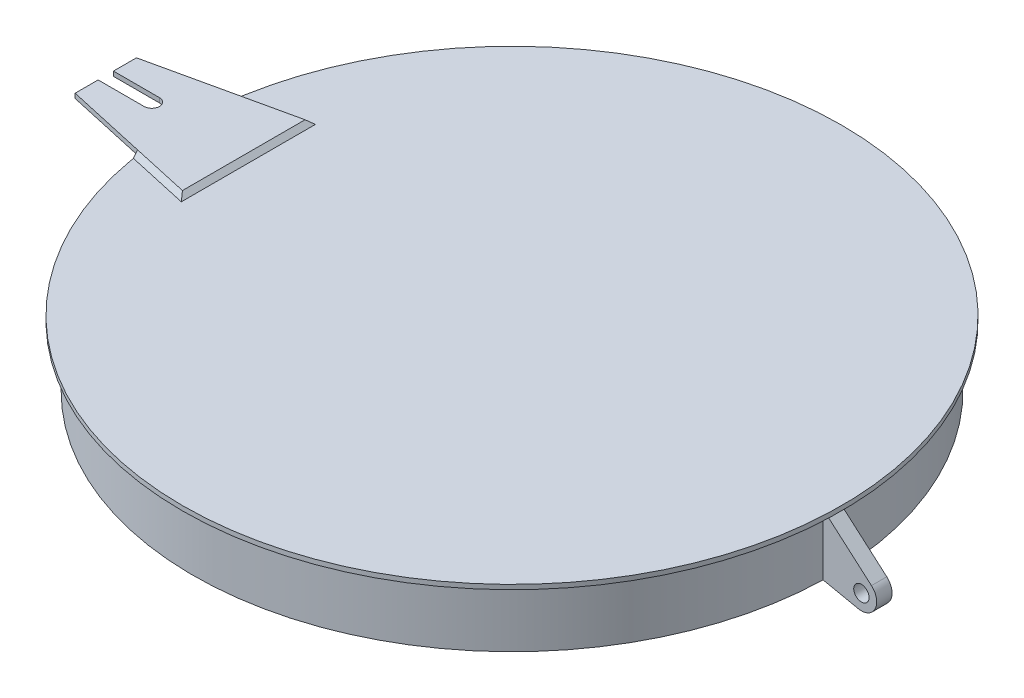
ISO-10303-21;
HEADER;
FILE_DESCRIPTION(('STEP AP214'),'2;1');
FILE_NAME('part.step','',(''),(''),'','','');
FILE_SCHEMA(('AUTOMOTIVE_DESIGN { 1 0 10303 214 1 1 1 1 }'));
ENDSEC;
DATA;
#1=APPLICATION_CONTEXT('core data for automotive mechanical design processes');
#2=APPLICATION_PROTOCOL_DEFINITION('international standard','automotive_design',2000,#1);
#3=PRODUCT_CONTEXT('',#1,'mechanical');
#4=PRODUCT('Part','Part','',(#3));
#5=PRODUCT_RELATED_PRODUCT_CATEGORY('part','',(#4));
#6=PRODUCT_DEFINITION_FORMATION('','',#4);
#7=PRODUCT_DEFINITION_CONTEXT('part definition',#1,'design');
#8=PRODUCT_DEFINITION('design','',#6,#7);
#9=PRODUCT_DEFINITION_SHAPE('','',#8);
#10=(LENGTH_UNIT() NAMED_UNIT(*) SI_UNIT(.MILLI.,.METRE.));
#11=(NAMED_UNIT(*) PLANE_ANGLE_UNIT() SI_UNIT($,.RADIAN.));
#12=(NAMED_UNIT(*) SI_UNIT($,.STERADIAN.) SOLID_ANGLE_UNIT());
#13=UNCERTAINTY_MEASURE_WITH_UNIT(LENGTH_MEASURE(1.E-05),#10,'distance_accuracy_value','');
#14=(GEOMETRIC_REPRESENTATION_CONTEXT(3) GLOBAL_UNCERTAINTY_ASSIGNED_CONTEXT((#13)) GLOBAL_UNIT_ASSIGNED_CONTEXT((#10,
#11,#12)) REPRESENTATION_CONTEXT('',''));
#15=CARTESIAN_POINT('',(0.,0.,0.));
#16=DIRECTION('',(0.,0.,1.));
#17=DIRECTION('',(1.,0.,0.));
#18=AXIS2_PLACEMENT_3D('',#15,#16,#17);
#19=CARTESIAN_POINT('',(204.939015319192,40.,5.0000000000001));
#20=DIRECTION('',(0.0243902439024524,0.,-0.999702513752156));
#21=DIRECTION('',(-0.999702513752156,0.,-0.0243902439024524));
#22=AXIS2_PLACEMENT_3D('',#19,#20,#21);
#23=PLANE('',#22);
#24=DIRECTION('',(-0.706896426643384,-0.707106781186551,-0.0172465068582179));
#25=VECTOR('',#24,1.);
#26=CARTESIAN_POINT('',(0.,-171.000000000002,-2.64119790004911E-12));
#27=LINE('',#26,#25);
#28=CARTESIAN_POINT('',(210.937230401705,40.,5.14634146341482));
#29=VERTEX_POINT('',#28);
#30=CARTESIAN_POINT('',(207.938122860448,37.,5.07317073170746));
#31=VERTEX_POINT('',#30);
#32=EDGE_CURVE('E59',#29,#31,#27,.T.);
#33=ORIENTED_EDGE('',*,*,#32,.T.);
#34=DIRECTION('',(0.,-1.,0.));
#35=VECTOR('',#34,1.);
#36=CARTESIAN_POINT('',(207.938122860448,40.,5.07317073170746));
#37=LINE('',#36,#35);
#38=CARTESIAN_POINT('',(207.938122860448,40.,5.07317073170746));
#39=VERTEX_POINT('',#38);
#40=EDGE_CURVE('E66',#39,#31,#37,.T.);
#41=ORIENTED_EDGE('',*,*,#40,.F.);
#42=DIRECTION('',(0.999702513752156,0.,0.0243902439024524));
#43=VECTOR('',#42,1.);
#44=CARTESIAN_POINT('',(204.939015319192,40.,5.0000000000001));
#45=LINE('',#44,#43);
#46=EDGE_CURVE('E89',#39,#29,#45,.T.);
#47=ORIENTED_EDGE('',*,*,#46,.T.);
#48=EDGE_LOOP('',(#33,#41,#47));
#49=FACE_BOUND('',#48,.T.);
#50=ADVANCED_FACE('F51',(#49),#23,.T.);
#51=CARTESIAN_POINT('',(207.938122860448,40.,-5.07317073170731));
#52=DIRECTION('',(0.0243902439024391,0.,0.999702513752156));
#53=DIRECTION('',(0.999702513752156,0.,-0.0243902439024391));
#54=AXIS2_PLACEMENT_3D('',#51,#52,#53);
#55=PLANE('',#54);
#56=DIRECTION('',(-0.999702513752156,0.,0.0243902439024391));
#57=VECTOR('',#56,1.);
#58=CARTESIAN_POINT('',(207.938122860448,40.,-5.07317073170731));
#59=LINE('',#58,#57);
#60=CARTESIAN_POINT('',(210.937230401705,40.,-5.14634146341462));
#61=VERTEX_POINT('',#60);
#62=CARTESIAN_POINT('',(207.938122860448,40.,-5.07317073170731));
#63=VERTEX_POINT('',#62);
#64=EDGE_CURVE('E88',#61,#63,#59,.T.);
#65=ORIENTED_EDGE('',*,*,#64,.T.);
#66=DIRECTION('',(0.,-1.,0.));
#67=VECTOR('',#66,1.);
#68=CARTESIAN_POINT('',(207.938122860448,40.,-5.07317073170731));
#69=LINE('',#68,#67);
#70=CARTESIAN_POINT('',(207.938122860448,37.,-5.07317073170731));
#71=VERTEX_POINT('',#70);
#72=EDGE_CURVE('E90',#63,#71,#69,.T.);
#73=ORIENTED_EDGE('',*,*,#72,.T.);
#74=DIRECTION('',(0.706896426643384,0.707106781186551,-0.0172465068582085));
#75=VECTOR('',#74,1.);
#76=CARTESIAN_POINT('',(0.,-171.000000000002,0.));
#77=LINE('',#76,#75);
#78=EDGE_CURVE('E12',#71,#61,#77,.T.);
#79=ORIENTED_EDGE('',*,*,#78,.T.);
#80=EDGE_LOOP('',(#65,#73,#79));
#81=FACE_BOUND('',#80,.T.);
#82=ADVANCED_FACE('F99',(#81),#55,.T.);
#83=CARTESIAN_POINT('',(0.,40.,0.));
#84=DIRECTION('',(0.,1.,0.));
#85=DIRECTION('',(0.,0.,1.));
#86=AXIS2_PLACEMENT_3D('',#83,#84,#85);
#87=CONICAL_SURFACE('',#86,211.,0.785398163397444);
#88=ORIENTED_EDGE('',*,*,#78,.F.);
#89=CARTESIAN_POINT('',(0.,37.,0.));
#90=DIRECTION('',(0.,1.,0.));
#91=DIRECTION('',(0.,0.,1.));
#92=AXIS2_PLACEMENT_3D('',#89,#90,#91);
#93=CIRCLE('',#92,208.);
#94=EDGE_CURVE('E95',#31,#71,#93,.F.);
#95=ORIENTED_EDGE('',*,*,#94,.F.);
#96=ORIENTED_EDGE('',*,*,#32,.F.);
#97=CARTESIAN_POINT('',(0.,40.,0.));
#98=DIRECTION('',(0.,1.,0.));
#99=DIRECTION('',(0.,0.,1.));
#100=AXIS2_PLACEMENT_3D('',#97,#98,#99);
#101=CIRCLE('',#100,211.);
#102=EDGE_CURVE('E74',#61,#29,#101,.T.);
#103=ORIENTED_EDGE('',*,*,#102,.F.);
#104=EDGE_LOOP('',(#88,#95,#96,#103));
#105=FACE_BOUND('',#104,.T.);
#106=ADVANCED_FACE('F53',(#105),#87,.T.);
#107=CARTESIAN_POINT('',(0.,40.,0.));
#108=DIRECTION('',(0.,-1.,0.));
#109=DIRECTION('',(0.,0.,-1.));
#110=AXIS2_PLACEMENT_3D('',#107,#108,#109);
#111=CYLINDRICAL_SURFACE('',#110,208.);
#112=ORIENTED_EDGE('',*,*,#94,.T.);
#113=ORIENTED_EDGE('',*,*,#72,.F.);
#114=CARTESIAN_POINT('',(0.,40.,0.));
#115=DIRECTION('',(0.,1.,0.));
#116=DIRECTION('',(0.,0.,1.));
#117=AXIS2_PLACEMENT_3D('',#114,#115,#116);
#118=CIRCLE('',#117,208.);
#119=EDGE_CURVE('E84',#63,#39,#118,.T.);
#120=ORIENTED_EDGE('',*,*,#119,.T.);
#121=ORIENTED_EDGE('',*,*,#40,.T.);
#122=EDGE_LOOP('',(#112,#113,#120,#121));
#123=FACE_BOUND('',#122,.T.);
#124=ADVANCED_FACE('F93',(#123),#111,.F.);
#125=CARTESIAN_POINT('',(0.,40.,0.));
#126=DIRECTION('',(0.,1.,0.));
#127=DIRECTION('',(0.,0.,1.));
#128=AXIS2_PLACEMENT_3D('',#125,#126,#127);
#129=PLANE('',#128);
#130=ORIENTED_EDGE('',*,*,#119,.F.);
#131=ORIENTED_EDGE('',*,*,#64,.F.);
#132=ORIENTED_EDGE('',*,*,#102,.T.);
#133=ORIENTED_EDGE('',*,*,#46,.F.);
#134=EDGE_LOOP('',(#130,#131,#132,#133));
#135=FACE_BOUND('',#134,.T.);
#136=ADVANCED_FACE('F86',(#135),#129,.T.);
#137=CLOSED_SHELL('',(#50,#82,#106,#124,#136));
#138=MANIFOLD_SOLID_BREP('B2',#137);
#139=CARTESIAN_POINT('',(0.,43.,0.));
#140=DIRECTION('',(0.,-1.,0.));
#141=DIRECTION('',(0.,0.,-1.));
#142=AXIS2_PLACEMENT_3D('',#139,#140,#141);
#143=CYLINDRICAL_SURFACE('',#142,215.);
#144=CARTESIAN_POINT('',(0.,123.010312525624,0.));
#145=DIRECTION('',(0.153392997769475,-0.707106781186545,0.690268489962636));
#146=DIRECTION('',(-0.153392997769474,-0.70710678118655,-0.690268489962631));
#147=AXIS2_PLACEMENT_3D('',#144,#145,#146);
#148=ELLIPSE('',#147,304.055915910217,215.);
#149=CARTESIAN_POINT('',(-212.660479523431,46.,-31.6310045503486));
#150=VERTEX_POINT('',#149);
#151=CARTESIAN_POINT('',(-212.162499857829,43.,-34.8148481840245));
#152=VERTEX_POINT('',#151);
#153=EDGE_CURVE('E173',#150,#152,#148,.T.);
#154=ORIENTED_EDGE('',*,*,#153,.T.);
#155=CARTESIAN_POINT('',(0.,43.,0.));
#156=DIRECTION('',(0.,1.,0.));
#157=DIRECTION('',(0.,0.,1.));
#158=AXIS2_PLACEMENT_3D('',#155,#156,#157);
#159=CIRCLE('',#158,215.);
#160=CARTESIAN_POINT('',(-212.660479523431,43.,-31.6310045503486));
#161=VERTEX_POINT('',#160);
#162=EDGE_CURVE('E237',#152,#161,#159,.T.);
#163=ORIENTED_EDGE('',*,*,#162,.T.);
#164=DIRECTION('',(0.,-1.,0.));
#165=VECTOR('',#164,1.);
#166=CARTESIAN_POINT('',(-212.660479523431,46.,-31.6310045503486));
#167=LINE('',#166,#165);
#168=EDGE_CURVE('E241',#150,#161,#167,.T.);
#169=ORIENTED_EDGE('',*,*,#168,.F.);
#170=EDGE_LOOP('',(#154,#163,#169));
#171=FACE_BOUND('',#170,.T.);
#172=ADVANCED_FACE('F164',(#171),#143,.T.);
#173=DIRECTION('',(0.,-1.,0.));
#174=VECTOR('',#173,1.);
#175=CARTESIAN_POINT('',(-212.660479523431,43.,31.6310045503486));
#176=LINE('',#175,#174);
#177=CARTESIAN_POINT('',(-212.660479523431,43.,31.6310045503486));
#178=VERTEX_POINT('',#177);
#179=CARTESIAN_POINT('',(-212.660479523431,46.,31.6310045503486));
#180=VERTEX_POINT('',#179);
#181=EDGE_CURVE('E222',#178,#180,#176,.F.);
#182=ORIENTED_EDGE('',*,*,#181,.F.);
#183=CARTESIAN_POINT('',(-212.162499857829,43.,34.8148481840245));
#184=VERTEX_POINT('',#183);
#185=EDGE_CURVE('E231',#178,#184,#159,.T.);
#186=ORIENTED_EDGE('',*,*,#185,.T.);
#187=CARTESIAN_POINT('',(0.,123.010312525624,0.));
#188=DIRECTION('',(0.153392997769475,-0.707106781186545,-0.690268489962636));
#189=DIRECTION('',(-0.153392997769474,-0.70710678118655,0.690268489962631));
#190=AXIS2_PLACEMENT_3D('',#187,#188,#189);
#191=ELLIPSE('',#190,304.055915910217,215.);
#192=EDGE_CURVE('E49',#184,#180,#191,.T.);
#193=ORIENTED_EDGE('',*,*,#192,.T.);
#194=EDGE_LOOP('',(#182,#186,#193));
#195=FACE_BOUND('',#194,.T.);
#196=ADVANCED_FACE('F239',(#195),#143,.T.);
#197=CARTESIAN_POINT('',(-17.3566737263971,43.,78.1050317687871));
#198=DIRECTION('',(0.153392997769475,-0.707106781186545,-0.690268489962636));
#199=DIRECTION('',(-0.976187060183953,0.,-0.216930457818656));
#200=AXIS2_PLACEMENT_3D('',#197,#198,#199);
#201=PLANE('',#200);
#202=ORIENTED_EDGE('',*,*,#192,.F.);
#203=DIRECTION('',(-0.976187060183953,0.,-0.216930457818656));
#204=VECTOR('',#203,1.);
#205=CARTESIAN_POINT('',(-17.3566737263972,43.,78.1050317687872));
#206=LINE('',#205,#204);
#207=CARTESIAN_POINT('',(-172.,43.,43.739848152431));
#208=VERTEX_POINT('',#207);
#209=EDGE_CURVE('E233',#208,#184,#206,.T.);
#210=ORIENTED_EDGE('',*,*,#209,.F.);
#211=DIRECTION('',(0.530442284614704,-0.530442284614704,0.661257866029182));
#212=VECTOR('',#211,1.);
#213=CARTESIAN_POINT('',(-187.342151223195,58.3421512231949,24.6140761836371));
#214=LINE('',#213,#212);
#215=CARTESIAN_POINT('',(-175.,46.,40.));
#216=VERTEX_POINT('',#215);
#217=EDGE_CURVE('E168',#216,#208,#214,.T.);
#218=ORIENTED_EDGE('',*,*,#217,.F.);
#219=DIRECTION('',(0.976187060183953,0.,0.216930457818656));
#220=VECTOR('',#219,1.);
#221=CARTESIAN_POINT('',(-240.647058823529,46.,25.4117647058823));
#222=LINE('',#221,#220);
#223=EDGE_CURVE('E254',#180,#216,#222,.T.);
#224=ORIENTED_EDGE('',*,*,#223,.F.);
#225=EDGE_LOOP('',(#202,#210,#218,#224));
#226=FACE_BOUND('',#225,.T.);
#227=ADVANCED_FACE('F166',(#226),#201,.F.);
#228=CARTESIAN_POINT('',(-172.,43.,0.));
#229=DIRECTION('',(-0.707106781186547,-0.707106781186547,0.));
#230=DIRECTION('',(0.,0.,1.));
#231=AXIS2_PLACEMENT_3D('',#228,#229,#230);
#232=PLANE('',#231);
#233=ORIENTED_EDGE('',*,*,#217,.T.);
#234=DIRECTION('',(0.,0.,1.));
#235=VECTOR('',#234,1.);
#236=CARTESIAN_POINT('',(-172.,43.,0.));
#237=LINE('',#236,#235);
#238=CARTESIAN_POINT('',(-172.,43.,-43.739848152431));
#239=VERTEX_POINT('',#238);
#240=EDGE_CURVE('E189',#239,#208,#237,.T.);
#241=ORIENTED_EDGE('',*,*,#240,.F.);
#242=DIRECTION('',(-0.530442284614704,0.530442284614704,0.661257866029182));
#243=VECTOR('',#242,1.);
#244=CARTESIAN_POINT('',(-187.342151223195,58.3421512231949,-24.6140761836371));
#245=LINE('',#244,#243);
#246=CARTESIAN_POINT('',(-175.,46.,-40.));
#247=VERTEX_POINT('',#246);
#248=EDGE_CURVE('E227',#247,#239,#245,.F.);
#249=ORIENTED_EDGE('',*,*,#248,.F.);
#250=DIRECTION('',(0.,0.,-1.));
#251=VECTOR('',#250,1.);
#252=CARTESIAN_POINT('',(-175.,46.,0.));
#253=LINE('',#252,#251);
#254=EDGE_CURVE('E261',#216,#247,#253,.T.);
#255=ORIENTED_EDGE('',*,*,#254,.F.);
#256=EDGE_LOOP('',(#233,#241,#249,#255));
#257=FACE_BOUND('',#256,.T.);
#258=ADVANCED_FACE('F278',(#257),#232,.F.);
#259=CARTESIAN_POINT('',(-17.3566737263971,43.,-78.1050317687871));
#260=DIRECTION('',(0.153392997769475,-0.707106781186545,0.690268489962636));
#261=DIRECTION('',(0.976187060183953,0.,-0.216930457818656));
#262=AXIS2_PLACEMENT_3D('',#259,#260,#261);
#263=PLANE('',#262);
#264=ORIENTED_EDGE('',*,*,#153,.F.);
#265=DIRECTION('',(-0.976187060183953,0.,0.216930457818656));
#266=VECTOR('',#265,1.);
#267=CARTESIAN_POINT('',(-240.647058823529,46.,-25.4117647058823));
#268=LINE('',#267,#266);
#269=EDGE_CURVE('E268',#247,#150,#268,.T.);
#270=ORIENTED_EDGE('',*,*,#269,.F.);
#271=ORIENTED_EDGE('',*,*,#248,.T.);
#272=DIRECTION('',(0.976187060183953,0.,-0.216930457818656));
#273=VECTOR('',#272,1.);
#274=CARTESIAN_POINT('',(-17.3566737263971,43.,-78.1050317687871));
#275=LINE('',#274,#273);
#276=EDGE_CURVE('E245',#152,#239,#275,.T.);
#277=ORIENTED_EDGE('',*,*,#276,.F.);
#278=EDGE_LOOP('',(#264,#270,#271,#277));
#279=FACE_BOUND('',#278,.T.);
#280=ADVANCED_FACE('F267',(#279),#263,.F.);
#281=CARTESIAN_POINT('',(-175.,46.,40.));
#282=DIRECTION('',(0.216930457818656,0.,-0.976187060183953));
#283=DIRECTION('',(-0.976187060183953,0.,-0.216930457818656));
#284=AXIS2_PLACEMENT_3D('',#281,#282,#283);
#285=PLANE('',#284);
#286=ORIENTED_EDGE('',*,*,#181,.T.);
#287=ORIENTED_EDGE('',*,*,#223,.T.);
#288=DIRECTION('',(0.,-1.,0.));
#289=VECTOR('',#288,1.);
#290=CARTESIAN_POINT('',(-175.,46.,40.));
#291=LINE('',#290,#289);
#292=CARTESIAN_POINT('',(-175.,43.,40.));
#293=VERTEX_POINT('',#292);
#294=EDGE_CURVE('E224',#216,#293,#291,.T.);
#295=ORIENTED_EDGE('',*,*,#294,.T.);
#296=DIRECTION('',(-0.976187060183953,0.,-0.216930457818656));
#297=VECTOR('',#296,1.);
#298=CARTESIAN_POINT('',(-16.7058823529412,43.,75.1764705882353));
#299=LINE('',#298,#297);
#300=EDGE_CURVE('E218',#293,#178,#299,.T.);
#301=ORIENTED_EDGE('',*,*,#300,.T.);
#302=EDGE_LOOP('',(#286,#287,#295,#301));
#303=FACE_BOUND('',#302,.T.);
#304=ADVANCED_FACE('F220',(#303),#285,.T.);
#305=CARTESIAN_POINT('',(0.,43.,0.));
#306=DIRECTION('',(0.,1.,0.));
#307=DIRECTION('',(0.,0.,1.));
#308=AXIS2_PLACEMENT_3D('',#305,#306,#307);
#309=PLANE('',#308);
#310=ORIENTED_EDGE('',*,*,#185,.F.);
#311=ORIENTED_EDGE('',*,*,#300,.F.);
#312=DIRECTION('',(0.,0.,1.));
#313=VECTOR('',#312,1.);
#314=CARTESIAN_POINT('',(-175.,43.,0.));
#315=LINE('',#314,#313);
#316=CARTESIAN_POINT('',(-175.,43.,-40.));
#317=VERTEX_POINT('',#316);
#318=EDGE_CURVE('E228',#317,#293,#315,.T.);
#319=ORIENTED_EDGE('',*,*,#318,.F.);
#320=DIRECTION('',(0.976187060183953,0.,-0.216930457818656));
#321=VECTOR('',#320,1.);
#322=CARTESIAN_POINT('',(-16.7058823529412,43.,-75.1764705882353));
#323=LINE('',#322,#321);
#324=EDGE_CURVE('E236',#161,#317,#323,.T.);
#325=ORIENTED_EDGE('',*,*,#324,.F.);
#326=ORIENTED_EDGE('',*,*,#162,.F.);
#327=ORIENTED_EDGE('',*,*,#276,.T.);
#328=ORIENTED_EDGE('',*,*,#240,.T.);
#329=ORIENTED_EDGE('',*,*,#209,.T.);
#330=EDGE_LOOP('',(#310,#311,#319,#325,#326,#327,#328,#329));
#331=FACE_BOUND('',#330,.T.);
#332=ADVANCED_FACE('F232',(#331),#309,.F.);
#333=CARTESIAN_POINT('',(-175.,46.,-40.));
#334=DIRECTION('',(0.216930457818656,0.,0.976187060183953));
#335=DIRECTION('',(0.976187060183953,0.,-0.216930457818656));
#336=AXIS2_PLACEMENT_3D('',#333,#334,#335);
#337=PLANE('',#336);
#338=ORIENTED_EDGE('',*,*,#168,.T.);
#339=ORIENTED_EDGE('',*,*,#324,.T.);
#340=DIRECTION('',(0.,-1.,0.));
#341=VECTOR('',#340,1.);
#342=CARTESIAN_POINT('',(-175.,46.,-40.));
#343=LINE('',#342,#341);
#344=EDGE_CURVE('E181',#247,#317,#343,.T.);
#345=ORIENTED_EDGE('',*,*,#344,.F.);
#346=ORIENTED_EDGE('',*,*,#269,.T.);
#347=EDGE_LOOP('',(#338,#339,#345,#346));
#348=FACE_BOUND('',#347,.T.);
#349=ADVANCED_FACE('F271',(#348),#337,.T.);
#350=CARTESIAN_POINT('',(-175.,46.,40.));
#351=DIRECTION('',(-1.,0.,0.));
#352=DIRECTION('',(0.,0.,1.));
#353=AXIS2_PLACEMENT_3D('',#350,#351,#352);
#354=PLANE('',#353);
#355=ORIENTED_EDGE('',*,*,#318,.T.);
#356=ORIENTED_EDGE('',*,*,#294,.F.);
#357=ORIENTED_EDGE('',*,*,#254,.T.);
#358=ORIENTED_EDGE('',*,*,#344,.T.);
#359=EDGE_LOOP('',(#355,#356,#357,#358));
#360=FACE_BOUND('',#359,.T.);
#361=ADVANCED_FACE('F277',(#360),#354,.T.);
#362=CLOSED_SHELL('',(#172,#196,#227,#258,#280,#304,#332,#349,#361));
#363=MANIFOLD_SOLID_BREP('B6',#362);
#364=CARTESIAN_POINT('',(-265.,46.,-20.));
#365=DIRECTION('',(1.,0.,0.));
#366=DIRECTION('',(0.,0.,-1.));
#367=AXIS2_PLACEMENT_3D('',#364,#365,#366);
#368=PLANE('',#367);
#369=DIRECTION('',(0.,0.,1.));
#370=VECTOR('',#369,1.);
#371=CARTESIAN_POINT('',(-265.,43.,-20.));
#372=LINE('',#371,#370);
#373=CARTESIAN_POINT('',(-265.,43.,-20.));
#374=VERTEX_POINT('',#373);
#375=CARTESIAN_POINT('',(-265.,43.,-5.));
#376=VERTEX_POINT('',#375);
#377=EDGE_CURVE('E467',#374,#376,#372,.T.);
#378=ORIENTED_EDGE('',*,*,#377,.T.);
#379=DIRECTION('',(0.,-1.,0.));
#380=VECTOR('',#379,1.);
#381=CARTESIAN_POINT('',(-265.,46.,-5.));
#382=LINE('',#381,#380);
#383=CARTESIAN_POINT('',(-265.,46.,-5.));
#384=VERTEX_POINT('',#383);
#385=EDGE_CURVE('E162',#384,#376,#382,.T.);
#386=ORIENTED_EDGE('',*,*,#385,.F.);
#387=DIRECTION('',(0.,0.,1.));
#388=VECTOR('',#387,1.);
#389=CARTESIAN_POINT('',(-265.,46.,-20.));
#390=LINE('',#389,#388);
#391=CARTESIAN_POINT('',(-265.,46.,-20.));
#392=VERTEX_POINT('',#391);
#393=EDGE_CURVE('E481',#392,#384,#390,.T.);
#394=ORIENTED_EDGE('',*,*,#393,.F.);
#395=DIRECTION('',(0.,-1.,0.));
#396=VECTOR('',#395,1.);
#397=CARTESIAN_POINT('',(-265.,46.,-20.));
#398=LINE('',#397,#396);
#399=EDGE_CURVE('E463',#392,#374,#398,.T.);
#400=ORIENTED_EDGE('',*,*,#399,.T.);
#401=EDGE_LOOP('',(#378,#386,#394,#400));
#402=FACE_BOUND('',#401,.T.);
#403=ADVANCED_FACE('F371',(#402),#368,.F.);
#404=CARTESIAN_POINT('',(-265.,46.,-5.));
#405=DIRECTION('',(0.,0.,-1.));
#406=DIRECTION('',(-1.,0.,0.));
#407=AXIS2_PLACEMENT_3D('',#404,#405,#406);
#408=PLANE('',#407);
#409=DIRECTION('',(1.,0.,0.));
#410=VECTOR('',#409,1.);
#411=CARTESIAN_POINT('',(-265.,43.,-5.));
#412=LINE('',#411,#410);
#413=CARTESIAN_POINT('',(-235.,43.,-5.));
#414=VERTEX_POINT('',#413);
#415=EDGE_CURVE('E470',#376,#414,#412,.T.);
#416=ORIENTED_EDGE('',*,*,#415,.T.);
#417=DIRECTION('',(0.,-1.,0.));
#418=VECTOR('',#417,1.);
#419=CARTESIAN_POINT('',(-235.,46.,-5.));
#420=LINE('',#419,#418);
#421=CARTESIAN_POINT('',(-235.,46.,-5.));
#422=VERTEX_POINT('',#421);
#423=EDGE_CURVE('E379',#422,#414,#420,.T.);
#424=ORIENTED_EDGE('',*,*,#423,.F.);
#425=DIRECTION('',(1.,0.,0.));
#426=VECTOR('',#425,1.);
#427=CARTESIAN_POINT('',(-265.,46.,-5.));
#428=LINE('',#427,#426);
#429=EDGE_CURVE('E430',#384,#422,#428,.T.);
#430=ORIENTED_EDGE('',*,*,#429,.F.);
#431=ORIENTED_EDGE('',*,*,#385,.T.);
#432=EDGE_LOOP('',(#416,#424,#430,#431));
#433=FACE_BOUND('',#432,.T.);
#434=ADVANCED_FACE('F516',(#433),#408,.F.);
#435=CARTESIAN_POINT('',(-235.,46.,0.));
#436=DIRECTION('',(0.,-1.,0.));
#437=DIRECTION('',(0.,0.,-1.));
#438=AXIS2_PLACEMENT_3D('',#435,#436,#437);
#439=CYLINDRICAL_SURFACE('',#438,5.);
#440=CARTESIAN_POINT('',(-235.,43.,0.));
#441=DIRECTION('',(0.,-1.,0.));
#442=DIRECTION('',(0.,0.,-1.));
#443=AXIS2_PLACEMENT_3D('',#440,#441,#442);
#444=CIRCLE('',#443,5.);
#445=CARTESIAN_POINT('',(-235.,43.,5.));
#446=VERTEX_POINT('',#445);
#447=EDGE_CURVE('E472',#414,#446,#444,.T.);
#448=ORIENTED_EDGE('',*,*,#447,.T.);
#449=DIRECTION('',(0.,-1.,0.));
#450=VECTOR('',#449,1.);
#451=CARTESIAN_POINT('',(-235.,46.,5.));
#452=LINE('',#451,#450);
#453=CARTESIAN_POINT('',(-235.,46.,5.));
#454=VERTEX_POINT('',#453);
#455=EDGE_CURVE('E488',#454,#446,#452,.T.);
#456=ORIENTED_EDGE('',*,*,#455,.F.);
#457=CARTESIAN_POINT('',(-235.,46.,0.));
#458=DIRECTION('',(0.,-1.,0.));
#459=DIRECTION('',(0.,0.,-1.));
#460=AXIS2_PLACEMENT_3D('',#457,#458,#459);
#461=CIRCLE('',#460,5.);
#462=EDGE_CURVE('E496',#422,#454,#461,.T.);
#463=ORIENTED_EDGE('',*,*,#462,.F.);
#464=ORIENTED_EDGE('',*,*,#423,.T.);
#465=EDGE_LOOP('',(#448,#456,#463,#464));
#466=FACE_BOUND('',#465,.T.);
#467=ADVANCED_FACE('F494',(#466),#439,.F.);
#468=CARTESIAN_POINT('',(-265.,46.,5.));
#469=DIRECTION('',(0.,0.,1.));
#470=DIRECTION('',(1.,0.,0.));
#471=AXIS2_PLACEMENT_3D('',#468,#469,#470);
#472=PLANE('',#471);
#473=DIRECTION('',(-1.,0.,0.));
#474=VECTOR('',#473,1.);
#475=CARTESIAN_POINT('',(-265.,43.,5.));
#476=LINE('',#475,#474);
#477=CARTESIAN_POINT('',(-265.,43.,5.));
#478=VERTEX_POINT('',#477);
#479=EDGE_CURVE('E474',#446,#478,#476,.T.);
#480=ORIENTED_EDGE('',*,*,#479,.T.);
#481=DIRECTION('',(0.,-1.,0.));
#482=VECTOR('',#481,1.);
#483=CARTESIAN_POINT('',(-265.,46.,5.));
#484=LINE('',#483,#482);
#485=CARTESIAN_POINT('',(-265.,46.,5.));
#486=VERTEX_POINT('',#485);
#487=EDGE_CURVE('E485',#486,#478,#484,.T.);
#488=ORIENTED_EDGE('',*,*,#487,.F.);
#489=DIRECTION('',(-1.,0.,0.));
#490=VECTOR('',#489,1.);
#491=CARTESIAN_POINT('',(-265.,46.,5.));
#492=LINE('',#491,#490);
#493=EDGE_CURVE('E508',#454,#486,#492,.T.);
#494=ORIENTED_EDGE('',*,*,#493,.F.);
#495=ORIENTED_EDGE('',*,*,#455,.T.);
#496=EDGE_LOOP('',(#480,#488,#494,#495));
#497=FACE_BOUND('',#496,.T.);
#498=ADVANCED_FACE('F504',(#497),#472,.F.);
#499=CARTESIAN_POINT('',(-265.,46.,20.));
#500=DIRECTION('',(1.,0.,0.));
#501=DIRECTION('',(0.,0.,-1.));
#502=AXIS2_PLACEMENT_3D('',#499,#500,#501);
#503=PLANE('',#502);
#504=DIRECTION('',(0.,0.,1.));
#505=VECTOR('',#504,1.);
#506=CARTESIAN_POINT('',(-265.,43.,20.));
#507=LINE('',#506,#505);
#508=CARTESIAN_POINT('',(-265.,43.,20.));
#509=VERTEX_POINT('',#508);
#510=EDGE_CURVE('E476',#478,#509,#507,.T.);
#511=ORIENTED_EDGE('',*,*,#510,.T.);
#512=DIRECTION('',(0.,-1.,0.));
#513=VECTOR('',#512,1.);
#514=CARTESIAN_POINT('',(-265.,46.,20.));
#515=LINE('',#514,#513);
#516=CARTESIAN_POINT('',(-265.,46.,20.));
#517=VERTEX_POINT('',#516);
#518=EDGE_CURVE('E458',#517,#509,#515,.T.);
#519=ORIENTED_EDGE('',*,*,#518,.F.);
#520=DIRECTION('',(0.,0.,1.));
#521=VECTOR('',#520,1.);
#522=CARTESIAN_POINT('',(-265.,46.,20.));
#523=LINE('',#522,#521);
#524=EDGE_CURVE('E449',#486,#517,#523,.T.);
#525=ORIENTED_EDGE('',*,*,#524,.F.);
#526=ORIENTED_EDGE('',*,*,#487,.T.);
#527=EDGE_LOOP('',(#511,#519,#525,#526));
#528=FACE_BOUND('',#527,.T.);
#529=ADVANCED_FACE('F507',(#528),#503,.F.);
#530=CARTESIAN_POINT('',(-175.,46.,40.));
#531=DIRECTION('',(0.216930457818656,0.,-0.976187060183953));
#532=DIRECTION('',(-0.976187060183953,0.,-0.216930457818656));
#533=AXIS2_PLACEMENT_3D('',#530,#531,#532);
#534=PLANE('',#533);
#535=DIRECTION('',(0.976187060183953,0.,0.216930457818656));
#536=VECTOR('',#535,1.);
#537=CARTESIAN_POINT('',(-175.,43.,40.));
#538=LINE('',#537,#536);
#539=CARTESIAN_POINT('',(-175.,43.,40.));
#540=VERTEX_POINT('',#539);
#541=EDGE_CURVE('E457',#509,#540,#538,.T.);
#542=ORIENTED_EDGE('',*,*,#541,.T.);
#543=DIRECTION('',(0.,-1.,0.));
#544=VECTOR('',#543,1.);
#545=CARTESIAN_POINT('',(-175.,46.,40.));
#546=LINE('',#545,#544);
#547=CARTESIAN_POINT('',(-175.,46.,40.));
#548=VERTEX_POINT('',#547);
#549=EDGE_CURVE('E454',#548,#540,#546,.T.);
#550=ORIENTED_EDGE('',*,*,#549,.F.);
#551=DIRECTION('',(0.976187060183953,0.,0.216930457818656));
#552=VECTOR('',#551,1.);
#553=CARTESIAN_POINT('',(-175.,46.,40.));
#554=LINE('',#553,#552);
#555=EDGE_CURVE('E443',#517,#548,#554,.T.);
#556=ORIENTED_EDGE('',*,*,#555,.F.);
#557=ORIENTED_EDGE('',*,*,#518,.T.);
#558=EDGE_LOOP('',(#542,#550,#556,#557));
#559=FACE_BOUND('',#558,.T.);
#560=ADVANCED_FACE('F455',(#559),#534,.F.);
#561=CARTESIAN_POINT('',(-175.,46.,40.));
#562=DIRECTION('',(-1.,0.,0.));
#563=DIRECTION('',(0.,0.,1.));
#564=AXIS2_PLACEMENT_3D('',#561,#562,#563);
#565=PLANE('',#564);
#566=DIRECTION('',(0.,0.,-1.));
#567=VECTOR('',#566,1.);
#568=CARTESIAN_POINT('',(-175.,43.,40.));
#569=LINE('',#568,#567);
#570=CARTESIAN_POINT('',(-175.,43.,-40.));
#571=VERTEX_POINT('',#570);
#572=EDGE_CURVE('E416',#540,#571,#569,.T.);
#573=ORIENTED_EDGE('',*,*,#572,.T.);
#574=DIRECTION('',(0.,-1.,0.));
#575=VECTOR('',#574,1.);
#576=CARTESIAN_POINT('',(-175.,46.,-40.));
#577=LINE('',#576,#575);
#578=CARTESIAN_POINT('',(-175.,46.,-40.));
#579=VERTEX_POINT('',#578);
#580=EDGE_CURVE('E459',#579,#571,#577,.T.);
#581=ORIENTED_EDGE('',*,*,#580,.F.);
#582=DIRECTION('',(0.,0.,-1.));
#583=VECTOR('',#582,1.);
#584=CARTESIAN_POINT('',(-175.,46.,40.));
#585=LINE('',#584,#583);
#586=EDGE_CURVE('E447',#548,#579,#585,.T.);
#587=ORIENTED_EDGE('',*,*,#586,.F.);
#588=ORIENTED_EDGE('',*,*,#549,.T.);
#589=EDGE_LOOP('',(#573,#581,#587,#588));
#590=FACE_BOUND('',#589,.T.);
#591=ADVANCED_FACE('F461',(#590),#565,.F.);
#592=CARTESIAN_POINT('',(-175.,46.,-40.));
#593=DIRECTION('',(0.216930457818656,0.,0.976187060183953));
#594=DIRECTION('',(0.976187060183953,0.,-0.216930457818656));
#595=AXIS2_PLACEMENT_3D('',#592,#593,#594);
#596=PLANE('',#595);
#597=DIRECTION('',(-0.976187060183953,0.,0.216930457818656));
#598=VECTOR('',#597,1.);
#599=CARTESIAN_POINT('',(-175.,43.,-40.));
#600=LINE('',#599,#598);
#601=EDGE_CURVE('E422',#571,#374,#600,.T.);
#602=ORIENTED_EDGE('',*,*,#601,.T.);
#603=ORIENTED_EDGE('',*,*,#399,.F.);
#604=DIRECTION('',(-0.976187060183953,0.,0.216930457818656));
#605=VECTOR('',#604,1.);
#606=CARTESIAN_POINT('',(-175.,46.,-40.));
#607=LINE('',#606,#605);
#608=EDGE_CURVE('E387',#579,#392,#607,.T.);
#609=ORIENTED_EDGE('',*,*,#608,.F.);
#610=ORIENTED_EDGE('',*,*,#580,.T.);
#611=EDGE_LOOP('',(#602,#603,#609,#610));
#612=FACE_BOUND('',#611,.T.);
#613=ADVANCED_FACE('F532',(#612),#596,.F.);
#614=CARTESIAN_POINT('',(-235.,46.,0.));
#615=DIRECTION('',(0.,-1.,0.));
#616=DIRECTION('',(0.,0.,-1.));
#617=AXIS2_PLACEMENT_3D('',#614,#615,#616);
#618=PLANE('',#617);
#619=ORIENTED_EDGE('',*,*,#393,.T.);
#620=ORIENTED_EDGE('',*,*,#429,.T.);
#621=ORIENTED_EDGE('',*,*,#462,.T.);
#622=ORIENTED_EDGE('',*,*,#493,.T.);
#623=ORIENTED_EDGE('',*,*,#524,.T.);
#624=ORIENTED_EDGE('',*,*,#555,.T.);
#625=ORIENTED_EDGE('',*,*,#586,.T.);
#626=ORIENTED_EDGE('',*,*,#608,.T.);
#627=EDGE_LOOP('',(#619,#620,#621,#622,#623,#624,#625,#626));
#628=FACE_BOUND('',#627,.T.);
#629=ADVANCED_FACE('F445',(#628),#618,.F.);
#630=CARTESIAN_POINT('',(-235.,43.,0.));
#631=DIRECTION('',(0.,-1.,0.));
#632=DIRECTION('',(0.,0.,-1.));
#633=AXIS2_PLACEMENT_3D('',#630,#631,#632);
#634=PLANE('',#633);
#635=ORIENTED_EDGE('',*,*,#377,.F.);
#636=ORIENTED_EDGE('',*,*,#601,.F.);
#637=ORIENTED_EDGE('',*,*,#572,.F.);
#638=ORIENTED_EDGE('',*,*,#541,.F.);
#639=ORIENTED_EDGE('',*,*,#510,.F.);
#640=ORIENTED_EDGE('',*,*,#479,.F.);
#641=ORIENTED_EDGE('',*,*,#447,.F.);
#642=ORIENTED_EDGE('',*,*,#415,.F.);
#643=EDGE_LOOP('',(#635,#636,#637,#638,#639,#640,#641,#642));
#644=FACE_BOUND('',#643,.T.);
#645=ADVANCED_FACE('F500',(#644),#634,.T.);
#646=CLOSED_SHELL('',(#403,#434,#467,#498,#529,#560,#591,#613,#629,#645));
#647=MANIFOLD_SOLID_BREP('B43',#646);
#648=CARTESIAN_POINT('',(232.938122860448,5.,5.));
#649=DIRECTION('',(0.,0.,-1.));
#650=DIRECTION('',(-1.,0.,0.));
#651=AXIS2_PLACEMENT_3D('',#648,#649,#650);
#652=PLANE('',#651);
#653=DIRECTION('',(0.,-1.,0.));
#654=VECTOR('',#653,1.);
#655=CARTESIAN_POINT('',(207.938122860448,0.,5.));
#656=LINE('',#655,#654);
#657=CARTESIAN_POINT('',(207.938122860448,40.,5.));
#658=VERTEX_POINT('',#657);
#659=CARTESIAN_POINT('',(207.938122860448,0.,5.));
#660=VERTEX_POINT('',#659);
#661=EDGE_CURVE('E678',#658,#660,#656,.T.);
#662=ORIENTED_EDGE('',*,*,#661,.T.);
#663=DIRECTION('',(0.978926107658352,-0.204214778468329,0.));
#664=VECTOR('',#663,1.);
#665=CARTESIAN_POINT('',(230.895975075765,-4.78926107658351,5.));
#666=LINE('',#665,#664);
#667=CARTESIAN_POINT('',(230.895975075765,-4.78926107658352,5.));
#668=VERTEX_POINT('',#667);
#669=EDGE_CURVE('E673',#660,#668,#666,.T.);
#670=ORIENTED_EDGE('',*,*,#669,.T.);
#671=CARTESIAN_POINT('',(232.938122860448,5.,5.));
#672=DIRECTION('',(0.,0.,1.));
#673=DIRECTION('',(-1.,0.,0.));
#674=AXIS2_PLACEMENT_3D('',#671,#672,#673);
#675=CIRCLE('',#674,9.99999999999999);
#676=CARTESIAN_POINT('',(239.501123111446,12.5450001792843,5.));
#677=VERTEX_POINT('',#676);
#678=EDGE_CURVE('E676',#668,#677,#675,.T.);
#679=ORIENTED_EDGE('',*,*,#678,.T.);
#680=DIRECTION('',(-0.754500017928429,0.656300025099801,0.));
#681=VECTOR('',#680,1.);
#682=CARTESIAN_POINT('',(207.938122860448,40.,5.));
#683=LINE('',#682,#681);
#684=EDGE_CURVE('E643',#677,#658,#683,.T.);
#685=ORIENTED_EDGE('',*,*,#684,.T.);
#686=EDGE_LOOP('',(#662,#670,#679,#685));
#687=FACE_BOUND('',#686,.T.);
#688=CARTESIAN_POINT('',(232.938122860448,5.,5.));
#689=DIRECTION('',(0.,0.,1.));
#690=DIRECTION('',(1.,0.,0.));
#691=AXIS2_PLACEMENT_3D('',#688,#689,#690);
#692=CIRCLE('',#691,4.99999999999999);
#693=CARTESIAN_POINT('',(237.938122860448,5.,5.));
#694=VERTEX_POINT('',#693);
#695=EDGE_CURVE('E693',#694,#694,#692,.T.);
#696=ORIENTED_EDGE('',*,*,#695,.F.);
#697=EDGE_LOOP('',(#696));
#698=FACE_BOUND('',#697,.T.);
#699=ADVANCED_FACE('F626',(#687,#698),#652,.F.);
#700=CARTESIAN_POINT('',(232.938122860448,5.,-5.));
#701=DIRECTION('',(0.,0.,-1.));
#702=DIRECTION('',(-1.,0.,0.));
#703=AXIS2_PLACEMENT_3D('',#700,#701,#702);
#704=PLANE('',#703);
#705=DIRECTION('',(0.,-1.,0.));
#706=VECTOR('',#705,1.);
#707=CARTESIAN_POINT('',(207.938122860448,0.,-5.));
#708=LINE('',#707,#706);
#709=CARTESIAN_POINT('',(207.938122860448,40.,-5.));
#710=VERTEX_POINT('',#709);
#711=CARTESIAN_POINT('',(207.938122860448,0.,-5.));
#712=VERTEX_POINT('',#711);
#713=EDGE_CURVE('E690',#710,#712,#708,.T.);
#714=ORIENTED_EDGE('',*,*,#713,.F.);
#715=DIRECTION('',(-0.754500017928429,0.656300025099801,0.));
#716=VECTOR('',#715,1.);
#717=CARTESIAN_POINT('',(207.938122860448,40.,-5.));
#718=LINE('',#717,#716);
#719=CARTESIAN_POINT('',(239.501123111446,12.5450001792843,-5.));
#720=VERTEX_POINT('',#719);
#721=EDGE_CURVE('E666',#720,#710,#718,.T.);
#722=ORIENTED_EDGE('',*,*,#721,.F.);
#723=CARTESIAN_POINT('',(232.938122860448,5.,-5.));
#724=DIRECTION('',(0.,0.,1.));
#725=DIRECTION('',(-1.,0.,0.));
#726=AXIS2_PLACEMENT_3D('',#723,#724,#725);
#727=CIRCLE('',#726,9.99999999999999);
#728=CARTESIAN_POINT('',(230.895975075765,-4.78926107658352,-5.));
#729=VERTEX_POINT('',#728);
#730=EDGE_CURVE('E660',#729,#720,#727,.T.);
#731=ORIENTED_EDGE('',*,*,#730,.F.);
#732=DIRECTION('',(0.978926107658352,-0.204214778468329,0.));
#733=VECTOR('',#732,1.);
#734=CARTESIAN_POINT('',(230.895975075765,-4.78926107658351,-5.));
#735=LINE('',#734,#733);
#736=EDGE_CURVE('E682',#712,#729,#735,.T.);
#737=ORIENTED_EDGE('',*,*,#736,.F.);
#738=EDGE_LOOP('',(#714,#722,#731,#737));
#739=FACE_BOUND('',#738,.T.);
#740=CARTESIAN_POINT('',(232.938122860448,5.,-5.));
#741=DIRECTION('',(0.,0.,1.));
#742=DIRECTION('',(1.,0.,0.));
#743=AXIS2_PLACEMENT_3D('',#740,#741,#742);
#744=CIRCLE('',#743,4.99999999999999);
#745=CARTESIAN_POINT('',(237.938122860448,5.,-5.));
#746=VERTEX_POINT('',#745);
#747=EDGE_CURVE('E705',#746,#746,#744,.T.);
#748=ORIENTED_EDGE('',*,*,#747,.T.);
#749=EDGE_LOOP('',(#748));
#750=FACE_BOUND('',#749,.T.);
#751=ADVANCED_FACE('F701',(#739,#750),#704,.T.);
#752=CARTESIAN_POINT('',(207.938122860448,0.,5.));
#753=DIRECTION('',(1.,0.,0.));
#754=DIRECTION('',(0.,0.,-1.));
#755=AXIS2_PLACEMENT_3D('',#752,#753,#754);
#756=PLANE('',#755);
#757=ORIENTED_EDGE('',*,*,#713,.T.);
#758=DIRECTION('',(0.,0.,-1.));
#759=VECTOR('',#758,1.);
#760=CARTESIAN_POINT('',(207.938122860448,0.,5.));
#761=LINE('',#760,#759);
#762=EDGE_CURVE('E369',#660,#712,#761,.T.);
#763=ORIENTED_EDGE('',*,*,#762,.F.);
#764=ORIENTED_EDGE('',*,*,#661,.F.);
#765=DIRECTION('',(0.,0.,-1.));
#766=VECTOR('',#765,1.);
#767=CARTESIAN_POINT('',(207.938122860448,40.,5.));
#768=LINE('',#767,#766);
#769=EDGE_CURVE('E686',#658,#710,#768,.T.);
#770=ORIENTED_EDGE('',*,*,#769,.T.);
#771=EDGE_LOOP('',(#757,#763,#764,#770));
#772=FACE_BOUND('',#771,.T.);
#773=ADVANCED_FACE('F628',(#772),#756,.F.);
#774=CARTESIAN_POINT('',(230.895975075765,-4.78926107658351,5.));
#775=DIRECTION('',(0.204214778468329,0.978926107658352,0.));
#776=DIRECTION('',(-0.978926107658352,0.204214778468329,0.));
#777=AXIS2_PLACEMENT_3D('',#774,#775,#776);
#778=PLANE('',#777);
#779=ORIENTED_EDGE('',*,*,#736,.T.);
#780=DIRECTION('',(0.,0.,-1.));
#781=VECTOR('',#780,1.);
#782=CARTESIAN_POINT('',(230.895975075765,-4.78926107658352,5.));
#783=LINE('',#782,#781);
#784=EDGE_CURVE('E635',#668,#729,#783,.T.);
#785=ORIENTED_EDGE('',*,*,#784,.F.);
#786=ORIENTED_EDGE('',*,*,#669,.F.);
#787=ORIENTED_EDGE('',*,*,#762,.T.);
#788=EDGE_LOOP('',(#779,#785,#786,#787));
#789=FACE_BOUND('',#788,.T.);
#790=ADVANCED_FACE('F681',(#789),#778,.F.);
#791=CARTESIAN_POINT('',(232.938122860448,5.,5.));
#792=DIRECTION('',(0.,0.,-1.));
#793=DIRECTION('',(-1.,0.,0.));
#794=AXIS2_PLACEMENT_3D('',#791,#792,#793);
#795=CYLINDRICAL_SURFACE('',#794,9.99999999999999);
#796=ORIENTED_EDGE('',*,*,#730,.T.);
#797=DIRECTION('',(0.,0.,-1.));
#798=VECTOR('',#797,1.);
#799=CARTESIAN_POINT('',(239.501123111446,12.5450001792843,5.));
#800=LINE('',#799,#798);
#801=EDGE_CURVE('E683',#677,#720,#800,.T.);
#802=ORIENTED_EDGE('',*,*,#801,.F.);
#803=ORIENTED_EDGE('',*,*,#678,.F.);
#804=ORIENTED_EDGE('',*,*,#784,.T.);
#805=EDGE_LOOP('',(#796,#802,#803,#804));
#806=FACE_BOUND('',#805,.T.);
#807=ADVANCED_FACE('F684',(#806),#795,.T.);
#808=CARTESIAN_POINT('',(207.938122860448,40.,5.));
#809=DIRECTION('',(-0.656300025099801,-0.754500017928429,0.));
#810=DIRECTION('',(0.754500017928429,-0.656300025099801,0.));
#811=AXIS2_PLACEMENT_3D('',#808,#809,#810);
#812=PLANE('',#811);
#813=ORIENTED_EDGE('',*,*,#721,.T.);
#814=ORIENTED_EDGE('',*,*,#769,.F.);
#815=ORIENTED_EDGE('',*,*,#684,.F.);
#816=ORIENTED_EDGE('',*,*,#801,.T.);
#817=EDGE_LOOP('',(#813,#814,#815,#816));
#818=FACE_BOUND('',#817,.T.);
#819=ADVANCED_FACE('F698',(#818),#812,.F.);
#820=CARTESIAN_POINT('',(232.938122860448,5.,5.));
#821=DIRECTION('',(0.,0.,-1.));
#822=DIRECTION('',(-1.,0.,0.));
#823=AXIS2_PLACEMENT_3D('',#820,#821,#822);
#824=CYLINDRICAL_SURFACE('',#823,4.99999999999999);
#825=ORIENTED_EDGE('',*,*,#695,.T.);
#826=EDGE_LOOP('',(#825));
#827=FACE_BOUND('',#826,.T.);
#828=ORIENTED_EDGE('',*,*,#747,.F.);
#829=EDGE_LOOP('',(#828));
#830=FACE_BOUND('',#829,.T.);
#831=ADVANCED_FACE('F711',(#827,#830),#824,.F.);
#832=CLOSED_SHELL('',(#699,#751,#773,#790,#807,#819,#831));
#833=MANIFOLD_SOLID_BREP('B156',#832);
#834=CARTESIAN_POINT('',(0.,43.,0.));
#835=DIRECTION('',(0.,-1.,0.));
#836=DIRECTION('',(0.,0.,-1.));
#837=AXIS2_PLACEMENT_3D('',#834,#835,#836);
#838=CYLINDRICAL_SURFACE('',#837,215.);
#839=CARTESIAN_POINT('',(0.,43.,0.));
#840=DIRECTION('',(0.,1.,0.));
#841=DIRECTION('',(0.,0.,1.));
#842=AXIS2_PLACEMENT_3D('',#839,#840,#841);
#843=CIRCLE('',#842,215.);
#844=CARTESIAN_POINT('',(0.,43.,215.));
#845=VERTEX_POINT('',#844);
#846=EDGE_CURVE('E625',#845,#845,#843,.T.);
#847=ORIENTED_EDGE('',*,*,#846,.F.);
#848=EDGE_LOOP('',(#847));
#849=FACE_BOUND('',#848,.T.);
#850=CARTESIAN_POINT('',(0.,40.,0.));
#851=DIRECTION('',(0.,1.,0.));
#852=DIRECTION('',(0.,0.,1.));
#853=AXIS2_PLACEMENT_3D('',#850,#851,#852);
#854=CIRCLE('',#853,215.);
#855=CARTESIAN_POINT('',(0.,40.,215.));
#856=VERTEX_POINT('',#855);
#857=EDGE_CURVE('E782',#856,#856,#854,.T.);
#858=ORIENTED_EDGE('',*,*,#857,.T.);
#859=EDGE_LOOP('',(#858));
#860=FACE_BOUND('',#859,.T.);
#861=ADVANCED_FACE('F779',(#849,#860),#838,.T.);
#862=CARTESIAN_POINT('',(0.,43.,0.));
#863=DIRECTION('',(0.,1.,0.));
#864=DIRECTION('',(0.,0.,1.));
#865=AXIS2_PLACEMENT_3D('',#862,#863,#864);
#866=PLANE('',#865);
#867=ORIENTED_EDGE('',*,*,#846,.T.);
#868=EDGE_LOOP('',(#867));
#869=FACE_BOUND('',#868,.T.);
#870=ADVANCED_FACE('F794',(#869),#866,.T.);
#871=CARTESIAN_POINT('',(0.,40.,0.));
#872=DIRECTION('',(0.,1.,0.));
#873=DIRECTION('',(0.,0.,1.));
#874=AXIS2_PLACEMENT_3D('',#871,#872,#873);
#875=PLANE('',#874);
#876=ORIENTED_EDGE('',*,*,#857,.F.);
#877=EDGE_LOOP('',(#876));
#878=FACE_BOUND('',#877,.T.);
#879=ADVANCED_FACE('F792',(#878),#875,.F.);
#880=CLOSED_SHELL('',(#861,#870,#879));
#881=MANIFOLD_SOLID_BREP('B363',#880);
#882=CARTESIAN_POINT('',(0.,40.,0.));
#883=DIRECTION('',(0.,-1.,0.));
#884=DIRECTION('',(0.,0.,-1.));
#885=AXIS2_PLACEMENT_3D('',#882,#883,#884);
#886=CYLINDRICAL_SURFACE('',#885,208.);
#887=CARTESIAN_POINT('',(0.,0.,0.));
#888=DIRECTION('',(0.,1.,0.));
#889=DIRECTION('',(1.,0.,0.));
#890=AXIS2_PLACEMENT_3D('',#887,#888,#889);
#891=CIRCLE('',#890,208.);
#892=CARTESIAN_POINT('',(207.938122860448,0.,-5.07317073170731));
#893=VERTEX_POINT('',#892);
#894=CARTESIAN_POINT('',(207.938122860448,0.,5.07317073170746));
#895=VERTEX_POINT('',#894);
#896=EDGE_CURVE('E888',#893,#895,#891,.T.);
#897=ORIENTED_EDGE('',*,*,#896,.T.);
#898=DIRECTION('',(0.,-1.,0.));
#899=VECTOR('',#898,1.);
#900=CARTESIAN_POINT('',(207.938122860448,40.,5.07317073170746));
#901=LINE('',#900,#899);
#902=CARTESIAN_POINT('',(207.938122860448,40.,5.07317073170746));
#903=VERTEX_POINT('',#902);
#904=EDGE_CURVE('E777',#903,#895,#901,.T.);
#905=ORIENTED_EDGE('',*,*,#904,.F.);
#906=CARTESIAN_POINT('',(0.,40.,0.));
#907=DIRECTION('',(0.,1.,0.));
#908=DIRECTION('',(1.,0.,0.));
#909=AXIS2_PLACEMENT_3D('',#906,#907,#908);
#910=CIRCLE('',#909,208.);
#911=CARTESIAN_POINT('',(207.938122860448,40.,-5.07317073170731));
#912=VERTEX_POINT('',#911);
#913=EDGE_CURVE('E865',#912,#903,#910,.T.);
#914=ORIENTED_EDGE('',*,*,#913,.F.);
#915=DIRECTION('',(0.,-1.,0.));
#916=VECTOR('',#915,1.);
#917=CARTESIAN_POINT('',(207.938122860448,40.,-5.07317073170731));
#918=LINE('',#917,#916);
#919=EDGE_CURVE('E841',#912,#893,#918,.T.);
#920=ORIENTED_EDGE('',*,*,#919,.T.);
#921=EDGE_LOOP('',(#897,#905,#914,#920));
#922=FACE_BOUND('',#921,.T.);
#923=ADVANCED_FACE('F825',(#922),#886,.T.);
#924=CARTESIAN_POINT('',(204.939015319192,40.,5.0000000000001));
#925=DIRECTION('',(0.0243902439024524,0.,-0.999702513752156));
#926=DIRECTION('',(-0.999702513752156,0.,-0.0243902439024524));
#927=AXIS2_PLACEMENT_3D('',#924,#925,#926);
#928=PLANE('',#927);
#929=DIRECTION('',(0.999702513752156,0.,0.0243902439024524));
#930=VECTOR('',#929,1.);
#931=CARTESIAN_POINT('',(204.939015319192,0.,5.0000000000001));
#932=LINE('',#931,#930);
#933=CARTESIAN_POINT('',(204.939015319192,0.,5.0000000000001));
#934=VERTEX_POINT('',#933);
#935=EDGE_CURVE('E874',#934,#895,#932,.T.);
#936=ORIENTED_EDGE('',*,*,#935,.F.);
#937=DIRECTION('',(0.,-1.,0.));
#938=VECTOR('',#937,1.);
#939=CARTESIAN_POINT('',(204.939015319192,40.,5.0000000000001));
#940=LINE('',#939,#938);
#941=CARTESIAN_POINT('',(204.939015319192,40.,5.0000000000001));
#942=VERTEX_POINT('',#941);
#943=EDGE_CURVE('E833',#942,#934,#940,.T.);
#944=ORIENTED_EDGE('',*,*,#943,.F.);
#945=DIRECTION('',(0.999702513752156,0.,0.0243902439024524));
#946=VECTOR('',#945,1.);
#947=CARTESIAN_POINT('',(204.939015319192,40.,5.0000000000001));
#948=LINE('',#947,#946);
#949=EDGE_CURVE('E872',#942,#903,#948,.T.);
#950=ORIENTED_EDGE('',*,*,#949,.T.);
#951=ORIENTED_EDGE('',*,*,#904,.T.);
#952=EDGE_LOOP('',(#936,#944,#950,#951));
#953=FACE_BOUND('',#952,.T.);
#954=ADVANCED_FACE('F871',(#953),#928,.T.);
#955=CARTESIAN_POINT('',(0.,40.,0.));
#956=DIRECTION('',(0.,-1.,0.));
#957=DIRECTION('',(0.,0.,-1.));
#958=AXIS2_PLACEMENT_3D('',#955,#956,#957);
#959=CYLINDRICAL_SURFACE('',#958,205.);
#960=CARTESIAN_POINT('',(0.,0.,0.));
#961=DIRECTION('',(0.,1.,0.));
#962=DIRECTION('',(0.,0.,1.));
#963=AXIS2_PLACEMENT_3D('',#960,#961,#962);
#964=CIRCLE('',#963,205.);
#965=CARTESIAN_POINT('',(204.939015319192,0.,-4.99999999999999));
#966=VERTEX_POINT('',#965);
#967=EDGE_CURVE('E891',#966,#934,#964,.T.);
#968=ORIENTED_EDGE('',*,*,#967,.F.);
#969=DIRECTION('',(0.,-1.,0.));
#970=VECTOR('',#969,1.);
#971=CARTESIAN_POINT('',(204.939015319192,40.,-4.99999999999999));
#972=LINE('',#971,#970);
#973=CARTESIAN_POINT('',(204.939015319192,40.,-4.99999999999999));
#974=VERTEX_POINT('',#973);
#975=EDGE_CURVE('E854',#974,#966,#972,.T.);
#976=ORIENTED_EDGE('',*,*,#975,.F.);
#977=CARTESIAN_POINT('',(0.,40.,0.));
#978=DIRECTION('',(0.,1.,0.));
#979=DIRECTION('',(0.,0.,1.));
#980=AXIS2_PLACEMENT_3D('',#977,#978,#979);
#981=CIRCLE('',#980,205.);
#982=EDGE_CURVE('E880',#974,#942,#981,.T.);
#983=ORIENTED_EDGE('',*,*,#982,.T.);
#984=ORIENTED_EDGE('',*,*,#943,.T.);
#985=EDGE_LOOP('',(#968,#976,#983,#984));
#986=FACE_BOUND('',#985,.T.);
#987=ADVANCED_FACE('F882',(#986),#959,.F.);
#988=CARTESIAN_POINT('',(207.938122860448,40.,-5.07317073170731));
#989=DIRECTION('',(0.0243902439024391,0.,0.999702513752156));
#990=DIRECTION('',(0.999702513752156,0.,-0.0243902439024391));
#991=AXIS2_PLACEMENT_3D('',#988,#989,#990);
#992=PLANE('',#991);
#993=DIRECTION('',(-0.999702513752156,0.,0.0243902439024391));
#994=VECTOR('',#993,1.);
#995=CARTESIAN_POINT('',(207.938122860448,0.,-5.07317073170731));
#996=LINE('',#995,#994);
#997=EDGE_CURVE('E893',#893,#966,#996,.T.);
#998=ORIENTED_EDGE('',*,*,#997,.F.);
#999=ORIENTED_EDGE('',*,*,#919,.F.);
#1000=DIRECTION('',(-0.999702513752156,0.,0.0243902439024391));
#1001=VECTOR('',#1000,1.);
#1002=CARTESIAN_POINT('',(207.938122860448,40.,-5.07317073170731));
#1003=LINE('',#1002,#1001);
#1004=EDGE_CURVE('E883',#912,#974,#1003,.T.);
#1005=ORIENTED_EDGE('',*,*,#1004,.T.);
#1006=ORIENTED_EDGE('',*,*,#975,.T.);
#1007=EDGE_LOOP('',(#998,#999,#1005,#1006));
#1008=FACE_BOUND('',#1007,.T.);
#1009=ADVANCED_FACE('F899',(#1008),#992,.T.);
#1010=CARTESIAN_POINT('',(0.,40.,0.));
#1011=DIRECTION('',(0.,1.,0.));
#1012=DIRECTION('',(1.,0.,0.));
#1013=AXIS2_PLACEMENT_3D('',#1010,#1011,#1012);
#1014=PLANE('',#1013);
#1015=ORIENTED_EDGE('',*,*,#913,.T.);
#1016=ORIENTED_EDGE('',*,*,#949,.F.);
#1017=ORIENTED_EDGE('',*,*,#982,.F.);
#1018=ORIENTED_EDGE('',*,*,#1004,.F.);
#1019=EDGE_LOOP('',(#1015,#1016,#1017,#1018));
#1020=FACE_BOUND('',#1019,.T.);
#1021=ADVANCED_FACE('F879',(#1020),#1014,.T.);
#1022=CARTESIAN_POINT('',(0.,0.,0.));
#1023=DIRECTION('',(0.,1.,0.));
#1024=DIRECTION('',(1.,0.,0.));
#1025=AXIS2_PLACEMENT_3D('',#1022,#1023,#1024);
#1026=PLANE('',#1025);
#1027=ORIENTED_EDGE('',*,*,#896,.F.);
#1028=ORIENTED_EDGE('',*,*,#997,.T.);
#1029=ORIENTED_EDGE('',*,*,#967,.T.);
#1030=ORIENTED_EDGE('',*,*,#935,.T.);
#1031=EDGE_LOOP('',(#1027,#1028,#1029,#1030));
#1032=FACE_BOUND('',#1031,.T.);
#1033=ADVANCED_FACE('F898',(#1032),#1026,.F.);
#1034=CLOSED_SHELL('',(#923,#954,#987,#1009,#1021,#1033));
#1035=MANIFOLD_SOLID_BREP('B620',#1034);
#1036=ADVANCED_BREP_SHAPE_REPRESENTATION('',(#18,#138,#363,#647,#833,#881,#1035),#14);
#1037=SHAPE_DEFINITION_REPRESENTATION(#9,#1036);
ENDSEC;
END-ISO-10303-21;
